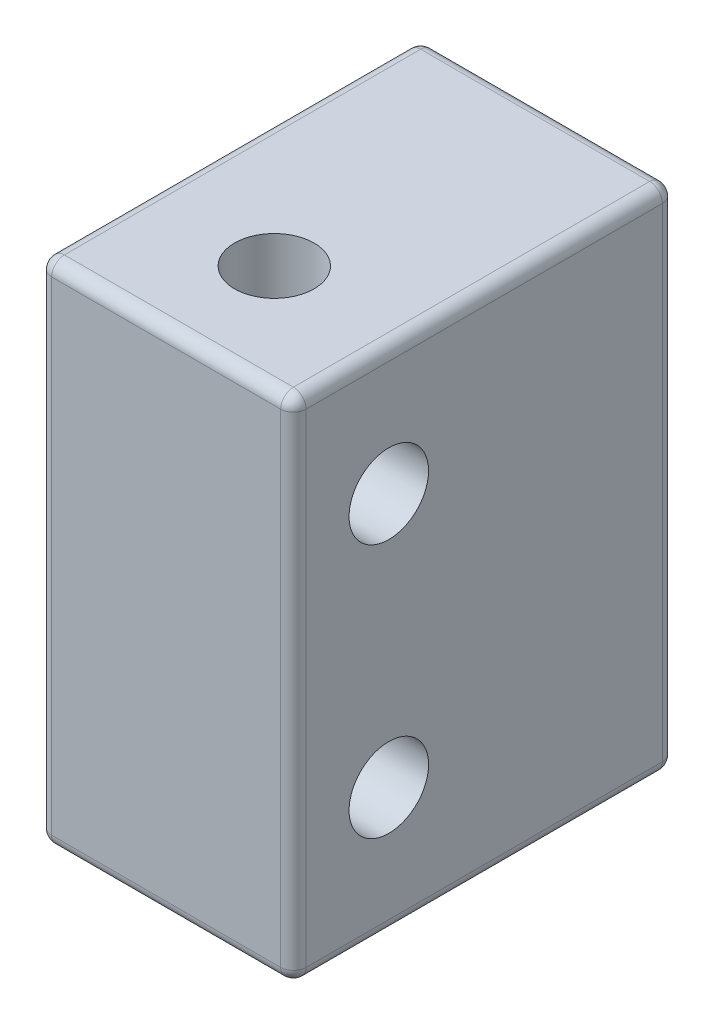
from build123d import *

# Parameters (mm, degrees)
SKETCH1_W          = 76.2
SKETCH1_H          = 101.6
EXTRUDE1_DEPTH     = 50.8
SKETCH2_R          = 7.9375
CUT_EXTRUDE1_DEPTH = 25.4
FILLET1_R          = 2.54
SKETCH3_R          = 7.9375
CUT_EXTRUDE3_DEPTH = 12.7


with BuildPart() as part:
    # Sketch1 → Extrude1 (new body)
    with BuildSketch(Plane(origin=(0, 0, 0), x_dir=(0, 0, -1), z_dir=(1, 0, 0))):
        Rectangle(SKETCH1_W, SKETCH1_H)
    extrude(amount=EXTRUDE1_DEPTH)

    # Sketch2 → Cut-Extrude1 (cut)
    with BuildSketch(Plane(origin=(50.8, 0, 0), x_dir=(0, 0, -1), z_dir=(1, 0, 0))):
        with Locations((-19.05, 25.4)):
            Circle(SKETCH2_R)
        with Locations((-19.05, -25.4)):
            Circle(SKETCH2_R)
    extrude(amount=-CUT_EXTRUDE1_DEPTH, mode=Mode.SUBTRACT)

    # Fillet1
    fillet1_edges = [part.edges().sort_by_distance(p)[0] for p in [
        (50.8, 0, -38.1),
        (50.8, 50.8, 0),
        (50.8, 0, 38.1),
        (0, 50.8, 0),
        (0, 0, -38.1),
        (0, -50.8, 0),
        (0, 0, 38.1),
        (50.8, -50.8, 0),
        (25.4, 50.8, 38.1),
        (25.4, 50.8, -38.1),
        (25.4, -50.8, -38.1),
        (25.4, -50.8, 38.1),
    ]]
    fillet(fillet1_edges, radius=FILLET1_R)

    # Sketch3 → Cut-Extrude3 (cut)
    with BuildSketch(Plane.XZ.offset(-50.8)):
        with Locations(Location((25.4, 16.51, 0), (0, 0, 270))):
            Circle(SKETCH3_R)
    extrude(amount=CUT_EXTRUDE3_DEPTH, mode=Mode.SUBTRACT)


solid = part.part
